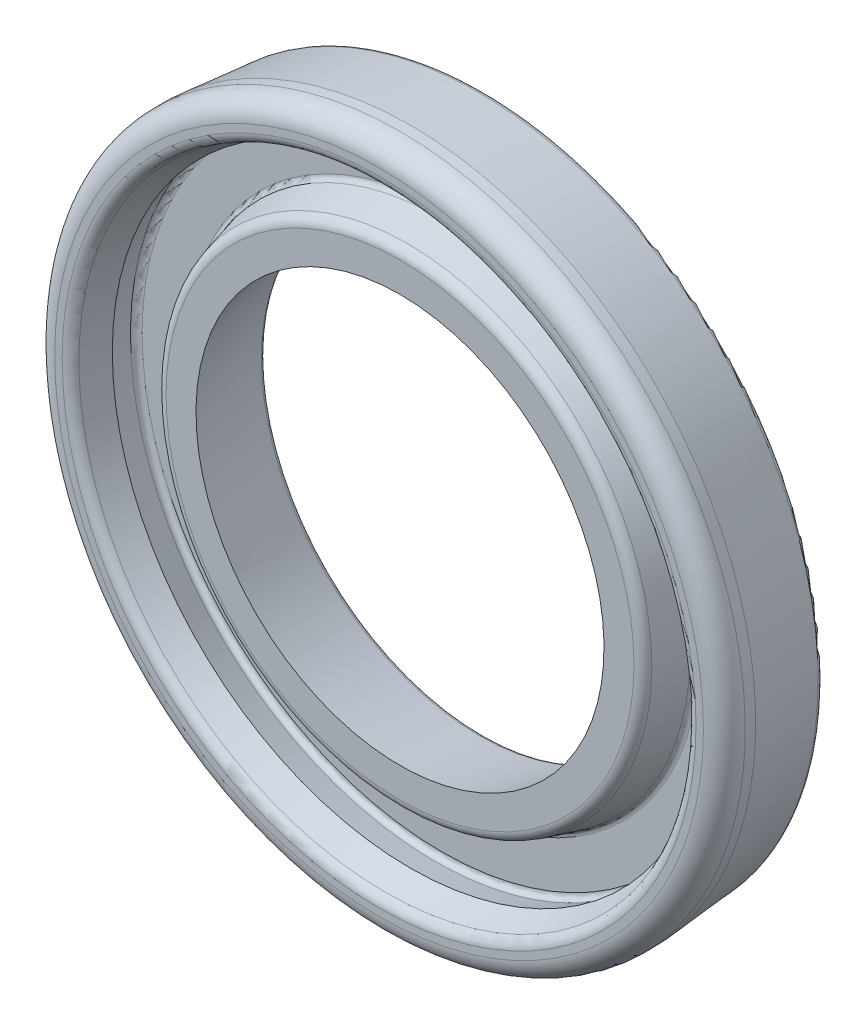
ISO-10303-21;
HEADER;
FILE_DESCRIPTION(('STEP AP214'),'2;1');
FILE_NAME('part.step','',(''),(''),'','','');
FILE_SCHEMA(('AUTOMOTIVE_DESIGN { 1 0 10303 214 1 1 1 1 }'));
ENDSEC;
DATA;
#1=APPLICATION_CONTEXT('core data for automotive mechanical design processes');
#2=APPLICATION_PROTOCOL_DEFINITION('international standard','automotive_design',2000,#1);
#3=PRODUCT_CONTEXT('',#1,'mechanical');
#4=PRODUCT('Part','Part','',(#3));
#5=PRODUCT_RELATED_PRODUCT_CATEGORY('part','',(#4));
#6=PRODUCT_DEFINITION_FORMATION('','',#4);
#7=PRODUCT_DEFINITION_CONTEXT('part definition',#1,'design');
#8=PRODUCT_DEFINITION('design','',#6,#7);
#9=PRODUCT_DEFINITION_SHAPE('','',#8);
#10=(LENGTH_UNIT() NAMED_UNIT(*) SI_UNIT(.MILLI.,.METRE.));
#11=(NAMED_UNIT(*) PLANE_ANGLE_UNIT() SI_UNIT($,.RADIAN.));
#12=(NAMED_UNIT(*) SI_UNIT($,.STERADIAN.) SOLID_ANGLE_UNIT());
#13=UNCERTAINTY_MEASURE_WITH_UNIT(LENGTH_MEASURE(1.E-05),#10,'distance_accuracy_value','');
#14=(GEOMETRIC_REPRESENTATION_CONTEXT(3) GLOBAL_UNCERTAINTY_ASSIGNED_CONTEXT((#13)) GLOBAL_UNIT_ASSIGNED_CONTEXT((#10,
#11,#12)) REPRESENTATION_CONTEXT('',''));
#15=CARTESIAN_POINT('',(0.,0.,0.));
#16=DIRECTION('',(0.,0.,1.));
#17=DIRECTION('',(1.,0.,0.));
#18=AXIS2_PLACEMENT_3D('',#15,#16,#17);
#19=CARTESIAN_POINT('',(0.,0.,4.62940950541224));
#20=DIRECTION('',(0.,0.,-1.));
#21=DIRECTION('',(0.,1.,0.));
#22=AXIS2_PLACEMENT_3D('',#19,#20,#21);
#23=CONICAL_SURFACE('',#22,29.1351977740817,0.26179938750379);
#24=CARTESIAN_POINT('',(0.,0.,4.62940950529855));
#25=DIRECTION('',(0.,0.,-1.));
#26=DIRECTION('',(1.60377400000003E-13,1.,0.));
#27=AXIS2_PLACEMENT_3D('',#24,#25,#26);
#28=CIRCLE('',#27,29.1351977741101);
#29=CARTESIAN_POINT('',(4.67262726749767E-12,29.1351977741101,4.62940950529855));
#30=VERTEX_POINT('',#29);
#31=EDGE_CURVE('E623',#30,#30,#28,.F.);
#32=ORIENTED_EDGE('',*,*,#31,.F.);
#33=EDGE_LOOP('',(#32));
#34=FACE_BOUND('',#33,.T.);
#35=CARTESIAN_POINT('',(0.,0.,7.00000001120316));
#36=DIRECTION('',(0.,0.,1.));
#37=DIRECTION('',(-1.96509499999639E-13,1.,0.));
#38=AXIS2_PLACEMENT_3D('',#35,#36,#37);
#39=CIRCLE('',#38,28.4999999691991);
#40=CARTESIAN_POINT('',(-5.60052074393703E-12,28.499999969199,7.00000001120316));
#41=VERTEX_POINT('',#40);
#42=EDGE_CURVE('E128',#41,#41,#39,.T.);
#43=ORIENTED_EDGE('',*,*,#42,.T.);
#44=EDGE_LOOP('',(#43));
#45=FACE_BOUND('',#44,.T.);
#46=ADVANCED_FACE('F16',(#34,#45),#23,.F.);
#47=CARTESIAN_POINT('',(0.,0.,4.5));
#48=DIRECTION('',(0.,0.,1.));
#49=DIRECTION('',(1.965095E-13,-1.,0.));
#50=AXIS2_PLACEMENT_3D('',#47,#48,#49);
#51=TOROIDAL_SURFACE('',#50,28.65223489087,0.5);
#52=ORIENTED_EDGE('',*,*,#31,.T.);
#53=EDGE_LOOP('',(#52));
#54=FACE_BOUND('',#53,.T.);
#55=CARTESIAN_POINT('',(0.,0.,4.));
#56=DIRECTION('',(0.,0.,-1.));
#57=DIRECTION('',(1.,1.96448267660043E-13,0.));
#58=AXIS2_PLACEMENT_3D('',#55,#56,#57);
#59=CIRCLE('',#58,28.652234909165);
#60=CARTESIAN_POINT('',(5.62923899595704E-12,-28.652234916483,4.));
#61=VERTEX_POINT('',#60);
#62=CARTESIAN_POINT('',(28.652234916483,-2.70863980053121E-11,4.));
#63=VERTEX_POINT('',#62);
#64=EDGE_CURVE('E115',#61,#63,#59,.F.);
#65=ORIENTED_EDGE('',*,*,#64,.F.);
#66=CARTESIAN_POINT('',(0.,0.,4.));
#67=DIRECTION('',(0.,0.,-1.));
#68=DIRECTION('',(1.96264570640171E-13,-1.,0.));
#69=AXIS2_PLACEMENT_3D('',#66,#67,#68);
#70=CIRCLE('',#69,28.652234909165);
#71=CARTESIAN_POINT('',(-28.652234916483,1.07323867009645E-11,4.));
#72=VERTEX_POINT('',#71);
#73=EDGE_CURVE('E118',#72,#61,#70,.F.);
#74=ORIENTED_EDGE('',*,*,#73,.F.);
#75=CARTESIAN_POINT('',(0.,0.,4.));
#76=DIRECTION('',(0.,0.,-1.));
#77=DIRECTION('',(-1.,-1.96325802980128E-13,0.));
#78=AXIS2_PLACEMENT_3D('',#75,#76,#77);
#79=CIRCLE('',#78,28.652234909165);
#80=CARTESIAN_POINT('',(-5.62713366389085E-12,28.652234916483,4.));
#81=VERTEX_POINT('',#80);
#82=EDGE_CURVE('E126',#81,#72,#79,.F.);
#83=ORIENTED_EDGE('',*,*,#82,.F.);
#84=CARTESIAN_POINT('',(0.,0.,4.));
#85=DIRECTION('',(0.,0.,-1.));
#86=DIRECTION('',(-1.96387035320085E-13,1.,0.));
#87=AXIS2_PLACEMENT_3D('',#84,#85,#86);
#88=CIRCLE('',#87,28.652234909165);
#89=EDGE_CURVE('E112',#63,#81,#88,.F.);
#90=ORIENTED_EDGE('',*,*,#89,.F.);
#91=EDGE_LOOP('',(#65,#74,#83,#90));
#92=FACE_BOUND('',#91,.T.);
#93=ADVANCED_FACE('F117',(#54,#92),#51,.F.);
#94=CARTESIAN_POINT('',(0.,0.,9.34201999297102));
#95=DIRECTION('',(0.,0.,1.));
#96=DIRECTION('',(0.,-1.,0.));
#97=AXIS2_PLACEMENT_3D('',#94,#95,#96);
#98=CONICAL_SURFACE('',#97,29.3524255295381,0.349065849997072);
#99=ORIENTED_EDGE('',*,*,#42,.F.);
#100=EDGE_LOOP('',(#99));
#101=FACE_BOUND('',#100,.T.);
#102=CARTESIAN_POINT('',(0.,0.,9.34201998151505));
#103=DIRECTION('',(0.,0.,1.));
#104=DIRECTION('',(1.965095E-13,-1.,0.));
#105=AXIS2_PLACEMENT_3D('',#102,#103,#104);
#106=CIRCLE('',#105,29.3524255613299);
#107=CARTESIAN_POINT('',(5.76803047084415E-12,-29.3524255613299,9.34201998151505));
#108=VERTEX_POINT('',#107);
#109=EDGE_CURVE('E206',#108,#108,#106,.F.);
#110=ORIENTED_EDGE('',*,*,#109,.F.);
#111=EDGE_LOOP('',(#110));
#112=FACE_BOUND('',#111,.T.);
#113=ADVANCED_FACE('F148',(#101,#112),#98,.F.);
#114=CARTESIAN_POINT('',(31.5174584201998,31.5174584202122,4.));
#115=DIRECTION('',(0.,0.,1.));
#116=DIRECTION('',(0.,-1.,0.));
#117=AXIS2_PLACEMENT_3D('',#114,#115,#116);
#118=PLANE('',#117);
#119=CARTESIAN_POINT('',(0.,0.,4.));
#120=DIRECTION('',(0.,0.,1.));
#121=DIRECTION('',(-1.,-1.96325802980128E-13,0.));
#122=AXIS2_PLACEMENT_3D('',#119,#120,#121);
#123=CIRCLE('',#122,24.58366344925);
#124=CARTESIAN_POINT('',(4.83034211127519E-12,-24.583663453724,4.));
#125=VERTEX_POINT('',#124);
#126=CARTESIAN_POINT('',(-24.583663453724,-4.82661438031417E-12,4.));
#127=VERTEX_POINT('',#126);
#128=EDGE_CURVE('E694',#125,#127,#123,.F.);
#129=ORIENTED_EDGE('',*,*,#128,.T.);
#130=CARTESIAN_POINT('',(0.,0.,4.));
#131=DIRECTION('',(0.,0.,1.));
#132=DIRECTION('',(-1.96387035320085E-13,1.,0.));
#133=AXIS2_PLACEMENT_3D('',#130,#131,#132);
#134=CIRCLE('',#133,24.58366344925);
#135=CARTESIAN_POINT('',(-4.82853573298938E-12,24.583663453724,4.));
#136=VERTEX_POINT('',#135);
#137=EDGE_CURVE('E189',#127,#136,#134,.F.);
#138=ORIENTED_EDGE('',*,*,#137,.T.);
#139=CARTESIAN_POINT('',(0.,0.,4.));
#140=DIRECTION('',(0.,0.,1.));
#141=DIRECTION('',(1.,1.96448267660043E-13,0.));
#142=AXIS2_PLACEMENT_3D('',#139,#140,#141);
#143=CIRCLE('',#142,24.58366344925);
#144=CARTESIAN_POINT('',(24.583663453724,4.82870225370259E-12,4.));
#145=VERTEX_POINT('',#144);
#146=EDGE_CURVE('E202',#136,#145,#143,.F.);
#147=ORIENTED_EDGE('',*,*,#146,.T.);
#148=CARTESIAN_POINT('',(0.,0.,4.));
#149=DIRECTION('',(0.,0.,1.));
#150=DIRECTION('',(1.965095E-13,-1.,0.));
#151=AXIS2_PLACEMENT_3D('',#148,#149,#150);
#152=CIRCLE('',#151,24.58366344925);
#153=EDGE_CURVE('E704',#145,#125,#152,.F.);
#154=ORIENTED_EDGE('',*,*,#153,.T.);
#155=EDGE_LOOP('',(#129,#138,#147,#154));
#156=FACE_BOUND('',#155,.T.);
#157=ORIENTED_EDGE('',*,*,#89,.T.);
#158=ORIENTED_EDGE('',*,*,#82,.T.);
#159=ORIENTED_EDGE('',*,*,#73,.T.);
#160=ORIENTED_EDGE('',*,*,#64,.T.);
#161=EDGE_LOOP('',(#157,#158,#159,#160));
#162=FACE_BOUND('',#161,.T.);
#163=ADVANCED_FACE('F125',(#156,#162),#118,.T.);
#164=CARTESIAN_POINT('',(0.,0.,9.));
#165=DIRECTION('',(0.,0.,1.));
#166=DIRECTION('',(1.965095E-13,-1.,0.));
#167=AXIS2_PLACEMENT_3D('',#164,#165,#166);
#168=TOROIDAL_SURFACE('',#167,30.29211824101,1.);
#169=CARTESIAN_POINT('',(0.,0.,9.99999999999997));
#170=DIRECTION('',(0.,0.,1.));
#171=DIRECTION('',(1.,1.96448267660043E-13,0.));
#172=AXIS2_PLACEMENT_3D('',#169,#170,#171);
#173=CIRCLE('',#172,30.292117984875);
#174=CARTESIAN_POINT('',(30.292117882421,5.95140547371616E-12,9.99999999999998));
#175=VERTEX_POINT('',#174);
#176=CARTESIAN_POINT('',(-5.9480403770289E-12,30.292117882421,9.99999999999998));
#177=VERTEX_POINT('',#176);
#178=EDGE_CURVE('E240',#175,#177,#173,.T.);
#179=ORIENTED_EDGE('',*,*,#178,.T.);
#180=CARTESIAN_POINT('',(0.,0.,9.99999999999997));
#181=DIRECTION('',(0.,0.,1.));
#182=DIRECTION('',(-1.96387035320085E-13,1.,0.));
#183=AXIS2_PLACEMENT_3D('',#180,#181,#182);
#184=CIRCLE('',#183,30.292117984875);
#185=CARTESIAN_POINT('',(-30.292117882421,-5.94903083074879E-12,9.99999999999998));
#186=VERTEX_POINT('',#185);
#187=EDGE_CURVE('E250',#177,#186,#184,.T.);
#188=ORIENTED_EDGE('',*,*,#187,.T.);
#189=CARTESIAN_POINT('',(0.,0.,9.99999999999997));
#190=DIRECTION('',(0.,0.,1.));
#191=DIRECTION('',(-1.,-1.96325802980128E-13,0.));
#192=AXIS2_PLACEMENT_3D('',#189,#190,#191);
#193=CIRCLE('',#192,30.292117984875);
#194=CARTESIAN_POINT('',(5.95026620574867E-12,-30.292117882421,9.99999999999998));
#195=VERTEX_POINT('',#194);
#196=EDGE_CURVE('E244',#186,#195,#193,.T.);
#197=ORIENTED_EDGE('',*,*,#196,.T.);
#198=CARTESIAN_POINT('',(0.,0.,9.99999999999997));
#199=DIRECTION('',(0.,0.,1.));
#200=DIRECTION('',(1.965095E-13,-1.,0.));
#201=AXIS2_PLACEMENT_3D('',#198,#199,#200);
#202=CIRCLE('',#201,30.292117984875);
#203=EDGE_CURVE('E234',#195,#175,#202,.T.);
#204=ORIENTED_EDGE('',*,*,#203,.T.);
#205=EDGE_LOOP('',(#179,#188,#197,#204));
#206=FACE_BOUND('',#205,.T.);
#207=ORIENTED_EDGE('',*,*,#109,.T.);
#208=EDGE_LOOP('',(#207));
#209=FACE_BOUND('',#208,.T.);
#210=ADVANCED_FACE('F147',(#206,#209),#168,.T.);
#211=CARTESIAN_POINT('',(0.,0.,4.5));
#212=DIRECTION('',(0.,0.,1.));
#213=DIRECTION('',(1.965095E-13,-1.,0.));
#214=AXIS2_PLACEMENT_3D('',#211,#212,#213);
#215=TOROIDAL_SURFACE('',#214,24.58366349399,0.5);
#216=CARTESIAN_POINT('',(0.,0.,4.37059048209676));
#217=DIRECTION('',(0.,0.,-1.));
#218=DIRECTION('',(1.96509500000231E-13,-1.,0.));
#219=AXIS2_PLACEMENT_3D('',#216,#217,#218);
#220=CIRCLE('',#219,24.1007005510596);
#221=CARTESIAN_POINT('',(4.73601661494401E-12,-24.1007005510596,4.37059048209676));
#222=VERTEX_POINT('',#221);
#223=EDGE_CURVE('E231',#222,#222,#220,.F.);
#224=ORIENTED_EDGE('',*,*,#223,.F.);
#225=EDGE_LOOP('',(#224));
#226=FACE_BOUND('',#225,.T.);
#227=ORIENTED_EDGE('',*,*,#137,.F.);
#228=ORIENTED_EDGE('',*,*,#128,.F.);
#229=ORIENTED_EDGE('',*,*,#153,.F.);
#230=ORIENTED_EDGE('',*,*,#146,.F.);
#231=EDGE_LOOP('',(#227,#228,#229,#230));
#232=FACE_BOUND('',#231,.T.);
#233=ADVANCED_FACE('F208',(#226,#232),#215,.F.);
#234=CARTESIAN_POINT('',(-34.0999999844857,34.0999999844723,10.));
#235=DIRECTION('',(0.,0.,-1.));
#236=DIRECTION('',(0.,1.,0.));
#237=AXIS2_PLACEMENT_3D('',#234,#235,#236);
#238=PLANE('',#237);
#239=ORIENTED_EDGE('',*,*,#196,.F.);
#240=ORIENTED_EDGE('',*,*,#187,.F.);
#241=ORIENTED_EDGE('',*,*,#178,.F.);
#242=ORIENTED_EDGE('',*,*,#203,.F.);
#243=EDGE_LOOP('',(#239,#240,#241,#242));
#244=FACE_BOUND('',#243,.T.);
#245=CARTESIAN_POINT('',(0.,0.,10.));
#246=DIRECTION('',(0.,0.,-1.));
#247=DIRECTION('',(-1.,-1.96693197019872E-13,0.));
#248=AXIS2_PLACEMENT_3D('',#245,#246,#247);
#249=CIRCLE('',#248,30.99999998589);
#250=CARTESIAN_POINT('',(-30.999999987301,-6.09580825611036E-12,10.));
#251=VERTEX_POINT('',#250);
#252=CARTESIAN_POINT('',(-6.09201623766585E-12,30.999999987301,10.));
#253=VERTEX_POINT('',#252);
#254=EDGE_CURVE('E233',#251,#253,#249,.T.);
#255=ORIENTED_EDGE('',*,*,#254,.F.);
#256=CARTESIAN_POINT('',(0.,0.,10.));
#257=DIRECTION('',(0.,0.,-1.));
#258=DIRECTION('',(1.96631964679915E-13,-1.,0.));
#259=AXIS2_PLACEMENT_3D('',#256,#257,#258);
#260=CIRCLE('',#259,30.99999998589);
#261=CARTESIAN_POINT('',(6.09429408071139E-12,-30.999999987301,10.));
#262=VERTEX_POINT('',#261);
#263=EDGE_CURVE('E292',#262,#251,#260,.T.);
#264=ORIENTED_EDGE('',*,*,#263,.F.);
#265=CARTESIAN_POINT('',(0.,0.,10.));
#266=DIRECTION('',(0.,0.,-1.));
#267=DIRECTION('',(1.,1.96126643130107E-13,0.));
#268=AXIS2_PLACEMENT_3D('',#265,#266,#267);
#269=CIRCLE('',#268,30.99999998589);
#270=CARTESIAN_POINT('',(30.999999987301,6.0786627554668E-12,10.));
#271=VERTEX_POINT('',#270);
#272=EDGE_CURVE('E298',#271,#262,#269,.T.);
#273=ORIENTED_EDGE('',*,*,#272,.F.);
#274=CARTESIAN_POINT('',(0.,0.,10.));
#275=DIRECTION('',(0.,0.,-1.));
#276=DIRECTION('',(-1.965095E-13,1.,0.));
#277=AXIS2_PLACEMENT_3D('',#274,#275,#276);
#278=CIRCLE('',#277,30.99999998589);
#279=EDGE_CURVE('E305',#253,#271,#278,.T.);
#280=ORIENTED_EDGE('',*,*,#279,.F.);
#281=EDGE_LOOP('',(#255,#264,#273,#280));
#282=FACE_BOUND('',#281,.T.);
#283=ADVANCED_FACE('F218',(#244,#282),#238,.F.);
#284=CARTESIAN_POINT('',(0.,0.,4.37059048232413));
#285=DIRECTION('',(0.,0.,-1.));
#286=DIRECTION('',(0.,1.,0.));
#287=AXIS2_PLACEMENT_3D('',#284,#285,#286);
#288=CONICAL_SURFACE('',#287,24.1007005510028,0.261799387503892);
#289=ORIENTED_EDGE('',*,*,#223,.T.);
#290=EDGE_LOOP('',(#289));
#291=FACE_BOUND('',#290,.T.);
#292=CARTESIAN_POINT('',(0.,0.,7.25881919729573));
#293=DIRECTION('',(0.,0.,1.));
#294=DIRECTION('',(1.965095E-13,-1.,0.));
#295=AXIS2_PLACEMENT_3D('',#292,#293,#294);
#296=CIRCLE('',#295,23.326802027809);
#297=CARTESIAN_POINT('',(4.58393820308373E-12,-23.326802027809,7.25881919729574));
#298=VERTEX_POINT('',#297);
#299=EDGE_CURVE('E301',#298,#298,#296,.T.);
#300=ORIENTED_EDGE('',*,*,#299,.F.);
#301=EDGE_LOOP('',(#300));
#302=FACE_BOUND('',#301,.T.);
#303=ADVANCED_FACE('F348',(#291,#302),#288,.T.);
#304=CARTESIAN_POINT('',(0.,0.,8.));
#305=DIRECTION('',(0.,0.,-1.));
#306=DIRECTION('',(-1.965095E-13,1.,0.));
#307=AXIS2_PLACEMENT_3D('',#304,#305,#306);
#308=TOROIDAL_SURFACE('',#307,31.,2.);
#309=ORIENTED_EDGE('',*,*,#254,.T.);
#310=ORIENTED_EDGE('',*,*,#279,.T.);
#311=ORIENTED_EDGE('',*,*,#272,.T.);
#312=ORIENTED_EDGE('',*,*,#263,.T.);
#313=EDGE_LOOP('',(#309,#310,#311,#312));
#314=FACE_BOUND('',#313,.T.);
#315=CARTESIAN_POINT('',(0.,0.,8.));
#316=DIRECTION('',(0.,0.,1.));
#317=DIRECTION('',(0.,-1.,0.));
#318=AXIS2_PLACEMENT_3D('',#315,#316,#317);
#319=CIRCLE('',#318,33.);
#320=CARTESIAN_POINT('',(0.,-33.,8.));
#321=VERTEX_POINT('',#320);
#322=EDGE_CURVE('E303',#321,#321,#319,.F.);
#323=ORIENTED_EDGE('',*,*,#322,.F.);
#324=EDGE_LOOP('',(#323));
#325=FACE_BOUND('',#324,.T.);
#326=ADVANCED_FACE('F293',(#314,#325),#308,.T.);
#327=CARTESIAN_POINT('',(0.,0.,7.));
#328=DIRECTION('',(0.,0.,1.));
#329=DIRECTION('',(1.965095E-13,-1.,0.));
#330=AXIS2_PLACEMENT_3D('',#327,#328,#329);
#331=TOROIDAL_SURFACE('',#330,22.3608762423,1.);
#332=ORIENTED_EDGE('',*,*,#299,.T.);
#333=EDGE_LOOP('',(#332));
#334=FACE_BOUND('',#333,.T.);
#335=CARTESIAN_POINT('',(0.,0.,7.99999999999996));
#336=DIRECTION('',(0.,0.,-1.));
#337=DIRECTION('',(-1.96387035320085E-13,1.,0.));
#338=AXIS2_PLACEMENT_3D('',#335,#336,#337);
#339=CIRCLE('',#338,22.360875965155);
#340=CARTESIAN_POINT('',(22.360875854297,4.39322679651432E-12,7.99999999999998));
#341=VERTEX_POINT('',#340);
#342=CARTESIAN_POINT('',(-4.39175961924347E-12,22.360875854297,7.99999999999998));
#343=VERTEX_POINT('',#342);
#344=EDGE_CURVE('E490',#341,#343,#339,.F.);
#345=ORIENTED_EDGE('',*,*,#344,.F.);
#346=CARTESIAN_POINT('',(0.,0.,7.99999999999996));
#347=DIRECTION('',(0.,0.,-1.));
#348=DIRECTION('',(1.,1.96448267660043E-13,0.));
#349=AXIS2_PLACEMENT_3D('',#346,#347,#348);
#350=CIRCLE('',#349,22.360875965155);
#351=CARTESIAN_POINT('',(4.39340266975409E-12,-22.360875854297,7.99999999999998));
#352=VERTEX_POINT('',#351);
#353=EDGE_CURVE('E404',#352,#341,#350,.F.);
#354=ORIENTED_EDGE('',*,*,#353,.F.);
#355=CARTESIAN_POINT('',(0.,0.,7.99999999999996));
#356=DIRECTION('',(0.,0.,-1.));
#357=DIRECTION('',(1.96264570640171E-13,-1.,0.));
#358=AXIS2_PLACEMENT_3D('',#355,#356,#357);
#359=CIRCLE('',#358,22.360875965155);
#360=CARTESIAN_POINT('',(-22.360875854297,-4.391095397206E-12,7.99999999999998));
#361=VERTEX_POINT('',#360);
#362=EDGE_CURVE('E382',#361,#352,#359,.F.);
#363=ORIENTED_EDGE('',*,*,#362,.F.);
#364=CARTESIAN_POINT('',(0.,0.,7.99999999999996));
#365=DIRECTION('',(0.,0.,-1.));
#366=DIRECTION('',(-1.,-1.96325802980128E-13,0.));
#367=AXIS2_PLACEMENT_3D('',#364,#365,#366);
#368=CIRCLE('',#367,22.360875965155);
#369=EDGE_CURVE('E338',#343,#361,#368,.F.);
#370=ORIENTED_EDGE('',*,*,#369,.F.);
#371=EDGE_LOOP('',(#345,#354,#363,#370));
#372=FACE_BOUND('',#371,.T.);
#373=ADVANCED_FACE('F347',(#334,#372),#331,.T.);
#374=CARTESIAN_POINT('',(0.,0.,10.5));
#375=DIRECTION('',(0.,0.,1.));
#376=DIRECTION('',(0.,-1.,0.));
#377=AXIS2_PLACEMENT_3D('',#374,#375,#376);
#378=CYLINDRICAL_SURFACE('',#377,33.);
#379=CARTESIAN_POINT('',(0.,0.,7.00000000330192));
#380=DIRECTION('',(0.,0.,1.));
#381=DIRECTION('',(-7.1837560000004E-13,1.,0.));
#382=AXIS2_PLACEMENT_3D('',#379,#380,#381);
#383=CIRCLE('',#382,32.9999999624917);
#384=CARTESIAN_POINT('',(-2.37063947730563E-11,32.9999999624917,7.00000000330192));
#385=VERTEX_POINT('',#384);
#386=EDGE_CURVE('E494',#385,#385,#383,.F.);
#387=ORIENTED_EDGE('',*,*,#386,.F.);
#388=EDGE_LOOP('',(#387));
#389=FACE_BOUND('',#388,.T.);
#390=ORIENTED_EDGE('',*,*,#322,.T.);
#391=EDGE_LOOP('',(#390));
#392=FACE_BOUND('',#391,.T.);
#393=ADVANCED_FACE('F472',(#389,#392),#378,.T.);
#394=CARTESIAN_POINT('',(24.5969632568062,24.5969632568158,8.));
#395=DIRECTION('',(0.,0.,1.));
#396=DIRECTION('',(0.,-1.,0.));
#397=AXIS2_PLACEMENT_3D('',#394,#395,#396);
#398=PLANE('',#397);
#399=CARTESIAN_POINT('',(0.,0.,7.99999999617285));
#400=DIRECTION('',(0.,0.,-1.));
#401=DIRECTION('',(0.,1.,0.));
#402=AXIS2_PLACEMENT_3D('',#399,#400,#401);
#403=CIRCLE('',#402,19.4999999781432);
#404=CARTESIAN_POINT('',(0.,19.4999999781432,7.99999999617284));
#405=VERTEX_POINT('',#404);
#406=EDGE_CURVE('E455',#405,#405,#403,.T.);
#407=ORIENTED_EDGE('',*,*,#406,.T.);
#408=EDGE_LOOP('',(#407));
#409=FACE_BOUND('',#408,.T.);
#410=ORIENTED_EDGE('',*,*,#353,.T.);
#411=ORIENTED_EDGE('',*,*,#344,.T.);
#412=ORIENTED_EDGE('',*,*,#369,.T.);
#413=ORIENTED_EDGE('',*,*,#362,.T.);
#414=EDGE_LOOP('',(#410,#411,#412,#413));
#415=FACE_BOUND('',#414,.T.);
#416=ADVANCED_FACE('F463',(#409,#415),#398,.T.);
#417=CARTESIAN_POINT('',(0.,0.,7.00000000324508));
#418=DIRECTION('',(0.,0.,1.));
#419=DIRECTION('',(0.,-1.,0.));
#420=AXIS2_PLACEMENT_3D('',#417,#418,#419);
#421=CONICAL_SURFACE('',#420,32.9999999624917,0.0872664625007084);
#422=ORIENTED_EDGE('',*,*,#386,.T.);
#423=EDGE_LOOP('',(#422));
#424=FACE_BOUND('',#423,.T.);
#425=CARTESIAN_POINT('',(0.,0.,0.456422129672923));
#426=DIRECTION('',(0.,0.,1.));
#427=DIRECTION('',(1.965095E-13,-1.,0.));
#428=AXIS2_PLACEMENT_3D('',#425,#426,#427);
#429=CIRCLE('',#428,32.4275111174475);
#430=CARTESIAN_POINT('',(6.37231399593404E-12,-32.4275111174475,0.456422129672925));
#431=VERTEX_POINT('',#430);
#432=EDGE_CURVE('E452',#431,#431,#429,.F.);
#433=ORIENTED_EDGE('',*,*,#432,.F.);
#434=EDGE_LOOP('',(#433));
#435=FACE_BOUND('',#434,.T.);
#436=ADVANCED_FACE('F471',(#424,#435),#421,.T.);
#437=CARTESIAN_POINT('',(0.,0.,0.413175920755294));
#438=DIRECTION('',(0.,0.,-1.));
#439=DIRECTION('',(0.,1.,0.));
#440=AXIS2_PLACEMENT_3D('',#437,#438,#439);
#441=CONICAL_SURFACE('',#440,20.837761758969,0.174532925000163);
#442=CARTESIAN_POINT('',(0.,0.,0.4131759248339));
#443=DIRECTION('',(0.,0.,1.));
#444=DIRECTION('',(1.965095E-13,-1.,0.));
#445=AXIS2_PLACEMENT_3D('',#442,#443,#444);
#446=CIRCLE('',#445,20.837761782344);
#447=CARTESIAN_POINT('',(4.09481814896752E-12,-20.837761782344,0.413175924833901));
#448=VERTEX_POINT('',#447);
#449=EDGE_CURVE('E443',#448,#448,#446,.T.);
#450=ORIENTED_EDGE('',*,*,#449,.F.);
#451=EDGE_LOOP('',(#450));
#452=FACE_BOUND('',#451,.T.);
#453=ORIENTED_EDGE('',*,*,#406,.F.);
#454=EDGE_LOOP('',(#453));
#455=FACE_BOUND('',#454,.T.);
#456=ADVANCED_FACE('F422',(#452,#455),#441,.F.);
#457=CARTESIAN_POINT('',(0.,0.,0.5));
#458=DIRECTION('',(0.,0.,1.));
#459=DIRECTION('',(1.965095E-13,-1.,0.));
#460=AXIS2_PLACEMENT_3D('',#457,#458,#459);
#461=TOROIDAL_SURFACE('',#460,31.92941376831,0.5);
#462=ORIENTED_EDGE('',*,*,#432,.T.);
#463=EDGE_LOOP('',(#462));
#464=FACE_BOUND('',#463,.T.);
#465=CARTESIAN_POINT('',(0.,0.,0.));
#466=DIRECTION('',(0.,0.,1.));
#467=DIRECTION('',(1.,1.96448267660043E-13,0.));
#468=AXIS2_PLACEMENT_3D('',#465,#466,#467);
#469=CIRCLE('',#468,31.9294137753);
#470=CARTESIAN_POINT('',(-6.27141778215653E-12,31.929413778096,0.));
#471=VERTEX_POINT('',#470);
#472=CARTESIAN_POINT('',(31.929413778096,6.27059733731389E-12,0.));
#473=VERTEX_POINT('',#472);
#474=EDGE_CURVE('E621',#471,#473,#469,.F.);
#475=ORIENTED_EDGE('',*,*,#474,.F.);
#476=CARTESIAN_POINT('',(0.,0.,0.));
#477=DIRECTION('',(0.,0.,1.));
#478=DIRECTION('',(-1.96387035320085E-13,1.,0.));
#479=AXIS2_PLACEMENT_3D('',#476,#477,#478);
#480=CIRCLE('',#479,31.9294137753);
#481=CARTESIAN_POINT('',(-31.929413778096,-6.26981529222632E-12,0.));
#482=VERTEX_POINT('',#481);
#483=EDGE_CURVE('E451',#482,#471,#480,.F.);
#484=ORIENTED_EDGE('',*,*,#483,.F.);
#485=CARTESIAN_POINT('',(0.,0.,0.));
#486=DIRECTION('',(0.,0.,1.));
#487=DIRECTION('',(-1.,-1.96325802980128E-13,0.));
#488=AXIS2_PLACEMENT_3D('',#485,#486,#487);
#489=CIRCLE('',#488,31.9294137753);
#490=CARTESIAN_POINT('',(6.27376391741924E-12,-31.929413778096,0.));
#491=VERTEX_POINT('',#490);
#492=EDGE_CURVE('E438',#491,#482,#489,.F.);
#493=ORIENTED_EDGE('',*,*,#492,.F.);
#494=CARTESIAN_POINT('',(0.,0.,0.));
#495=DIRECTION('',(0.,0.,1.));
#496=DIRECTION('',(1.965095E-13,-1.,0.));
#497=AXIS2_PLACEMENT_3D('',#494,#495,#496);
#498=CIRCLE('',#497,31.9294137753);
#499=EDGE_CURVE('E612',#473,#491,#498,.F.);
#500=ORIENTED_EDGE('',*,*,#499,.F.);
#501=EDGE_LOOP('',(#475,#484,#493,#500));
#502=FACE_BOUND('',#501,.T.);
#503=ADVANCED_FACE('F410',(#464,#502),#461,.T.);
#504=CARTESIAN_POINT('',(0.,0.,0.5));
#505=DIRECTION('',(0.,0.,1.));
#506=DIRECTION('',(1.965095E-13,-1.,0.));
#507=AXIS2_PLACEMENT_3D('',#504,#505,#506);
#508=TOROIDAL_SURFACE('',#507,21.33016566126,0.5);
#509=ORIENTED_EDGE('',*,*,#449,.T.);
#510=EDGE_LOOP('',(#509));
#511=FACE_BOUND('',#510,.T.);
#512=CARTESIAN_POINT('',(0.,0.,0.));
#513=DIRECTION('',(0.,0.,-1.));
#514=DIRECTION('',(-1.,-1.96325802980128E-13,0.));
#515=AXIS2_PLACEMENT_3D('',#512,#513,#514);
#516=CIRCLE('',#515,21.33016562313);
#517=CARTESIAN_POINT('',(-4.18981756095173E-12,21.330165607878,0.));
#518=VERTEX_POINT('',#517);
#519=CARTESIAN_POINT('',(-21.330165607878,-4.18921343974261E-12,0.));
#520=VERTEX_POINT('',#519);
#521=EDGE_CURVE('E572',#518,#520,#516,.F.);
#522=ORIENTED_EDGE('',*,*,#521,.F.);
#523=CARTESIAN_POINT('',(0.,0.,0.));
#524=DIRECTION('',(0.,0.,-1.));
#525=DIRECTION('',(-1.96387035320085E-13,1.,0.));
#526=AXIS2_PLACEMENT_3D('',#523,#524,#525);
#527=CIRCLE('',#526,21.33016562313);
#528=CARTESIAN_POINT('',(21.330165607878,4.18973587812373E-12,0.));
#529=VERTEX_POINT('',#528);
#530=EDGE_CURVE('E570',#529,#518,#527,.F.);
#531=ORIENTED_EDGE('',*,*,#530,.F.);
#532=CARTESIAN_POINT('',(0.,0.,0.));
#533=DIRECTION('',(0.,0.,-1.));
#534=DIRECTION('',(1.,1.96448267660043E-13,0.));
#535=AXIS2_PLACEMENT_3D('',#532,#533,#534);
#536=CIRCLE('',#535,21.33016562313);
#537=CARTESIAN_POINT('',(4.19138487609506E-12,-21.330165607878,0.));
#538=VERTEX_POINT('',#537);
#539=EDGE_CURVE('E10',#538,#529,#536,.F.);
#540=ORIENTED_EDGE('',*,*,#539,.F.);
#541=CARTESIAN_POINT('',(0.,0.,0.));
#542=DIRECTION('',(0.,0.,-1.));
#543=DIRECTION('',(1.96264570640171E-13,-1.,0.));
#544=AXIS2_PLACEMENT_3D('',#541,#542,#543);
#545=CIRCLE('',#544,21.33016562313);
#546=EDGE_CURVE('E26',#520,#538,#545,.F.);
#547=ORIENTED_EDGE('',*,*,#546,.F.);
#548=EDGE_LOOP('',(#522,#531,#540,#547));
#549=FACE_BOUND('',#548,.T.);
#550=ADVANCED_FACE('F421',(#511,#549),#508,.T.);
#551=CARTESIAN_POINT('',(-35.1223551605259,35.1223551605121,0.));
#552=DIRECTION('',(0.,0.,-1.));
#553=DIRECTION('',(0.,1.,0.));
#554=AXIS2_PLACEMENT_3D('',#551,#552,#553);
#555=PLANE('',#554);
#556=ORIENTED_EDGE('',*,*,#546,.T.);
#557=ORIENTED_EDGE('',*,*,#539,.T.);
#558=ORIENTED_EDGE('',*,*,#530,.T.);
#559=ORIENTED_EDGE('',*,*,#521,.T.);
#560=EDGE_LOOP('',(#556,#557,#558,#559));
#561=FACE_BOUND('',#560,.T.);
#562=ORIENTED_EDGE('',*,*,#499,.T.);
#563=ORIENTED_EDGE('',*,*,#492,.T.);
#564=ORIENTED_EDGE('',*,*,#483,.T.);
#565=ORIENTED_EDGE('',*,*,#474,.T.);
#566=EDGE_LOOP('',(#562,#563,#564,#565));
#567=FACE_BOUND('',#566,.T.);
#568=ADVANCED_FACE('F509',(#561,#567),#555,.T.);
#569=CLOSED_SHELL('',(#46,#93,#113,#163,#210,#233,#283,#303,#326,#373,#393,#416,#436,#456,#503,
#550,#568));
#570=MANIFOLD_SOLID_BREP('B1',#569);
#571=ADVANCED_BREP_SHAPE_REPRESENTATION('',(#18,#570),#14);
#572=SHAPE_DEFINITION_REPRESENTATION(#9,#571);
ENDSEC;
END-ISO-10303-21;
